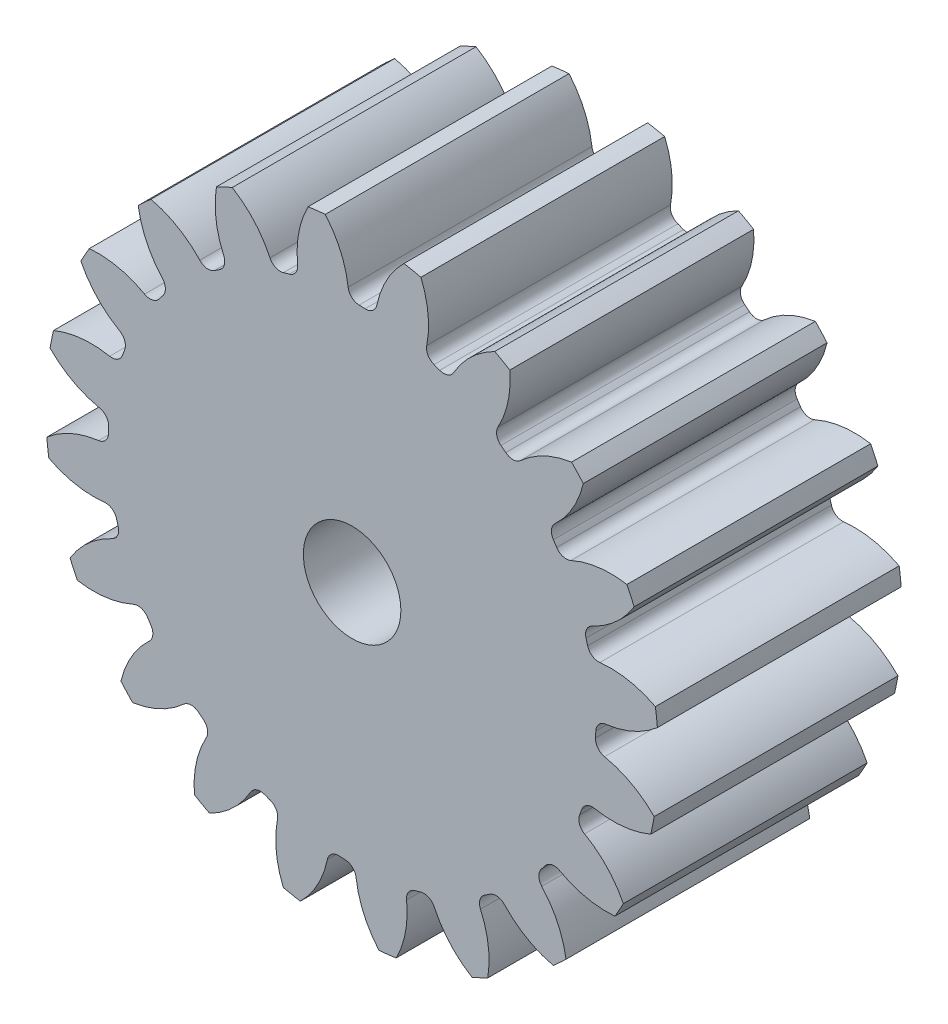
from build123d import *

# Parameters (mm, degrees)
SKETCH3_R         = 111.76
GEARBODY_DEPTH    = 88.9
TOOTHCUT_DEPTH    = 182.338923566
CIRPATTERN1_COUNT = 20
BOREDIA_R         = 17.78
BORE_DEPTH        = 12700


with BuildPart() as part:
    # Sketch3 → gearBody (new body)
    with BuildSketch(Plane.XY):
        Circle(SKETCH3_R)
    extrude(amount=GEARBODY_DEPTH)

    # Sketch2 → toothCut (cut, through all)
    with BuildSketch(Plane.XY):
        with BuildLine():
            ThreePointArc((88.772675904, -4.756260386), (88.825021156, -3.650426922), (88.863591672, -2.544027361))
            ThreePointArc((88.863591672, -2.544027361), (89.940266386, 0.122506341), (92.495266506, 1.442205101))
            ThreePointArc((92.495266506, 1.442205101), (102.795573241, 4.331930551), (111.76, 10.170242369))
            ThreePointArc((111.76, 10.170242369), (112.127147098, -4.608070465), (110.548602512, -19.306421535))
            ThreePointArc((110.548602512, -19.306421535), (102.093468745, -12.752220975), (92.065013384, -9.027047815))
            ThreePointArc((92.065013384, -9.027047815), (89.626917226, -7.502148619), (88.772675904, -4.756260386))
        make_face()
    toothcut = extrude(amount=TOOTHCUT_DEPTH, mode=Mode.SUBTRACT)

    # CirPattern1: toothCut ×20 about axis
    cirpattern1_axis = Axis((0, 0, 0), (0, 0, 1))
    for i in range(1, CIRPATTERN1_COUNT):
        add(toothcut.rotate(cirpattern1_axis, i * 360 / CIRPATTERN1_COUNT), mode=Mode.SUBTRACT)

    # boreDia → bore (cut, symmetric)
    with BuildSketch(Plane.XY):
        Circle(BOREDIA_R)
    extrude(amount=BORE_DEPTH, both=True, mode=Mode.SUBTRACT)


solid = part.part
